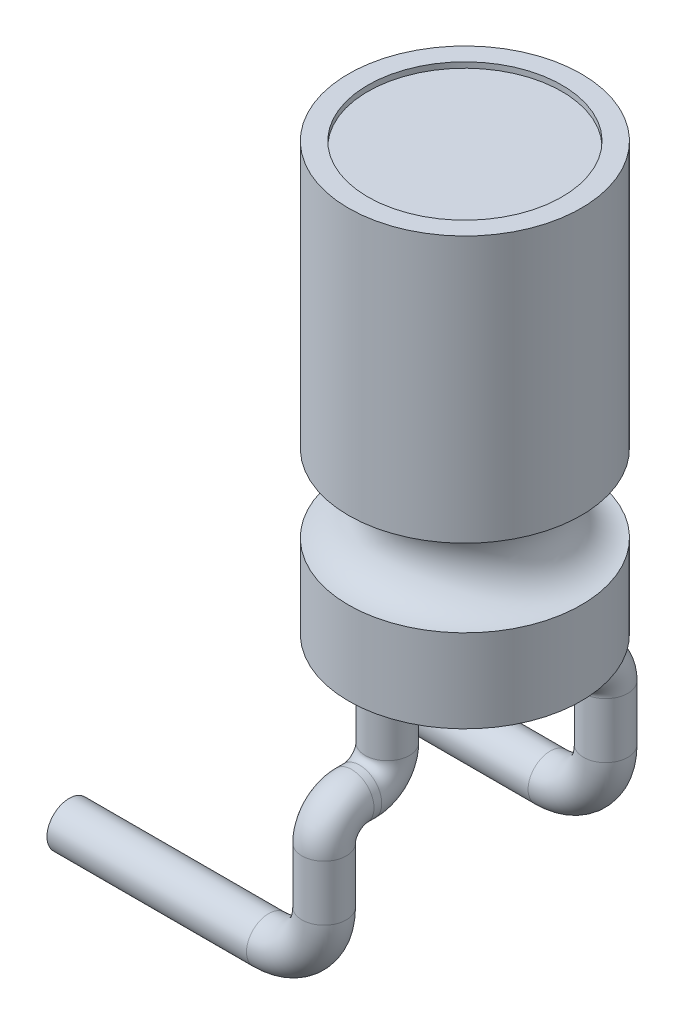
from build123d import *

# Parameters (mm, degrees)
ESQUISSE2_R             = 1.75
ENL_V_MAT_EXTRU_1_DEPTH = 0.1
ESQUISSE3_R             = 0.4
ESQUISSE5_R             = 0.4


with BuildPart() as part:
    # Esquisse1 → R_volution1 (revolve)
    with BuildSketch(Plane.XY, mode=Mode.PRIVATE) as r_volution1_sk:
        with BuildLine():
            Line((0, 35.216423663), (2.1, 35.216423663))
            Line((2.1, 35.216423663), (2.1, 30.416423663))
            ThreePointArc((2.1, 30.416423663), (1.4, 29.716423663), (2.1, 29.016423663))
            Line((2.1, 29.016423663), (2.1, 27.516423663))
            Line((2.1, 27.516423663), (0, 27.516423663))
            Line((0, 27.516423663), (0, 35.216423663))
        make_face()
    revolve(r_volution1_sk.sketch.rotate(Axis((0, 48.401709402, 0), (0, -1, 0)), 90), axis=Axis((0, 48.401709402, 0), (0, -1, 0)))

    # Esquisse2 → Enl_v. mat.-Extru.1 (cut)
    with BuildSketch(Plane(origin=(0, 35.216423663, 0), x_dir=(-1, 0, 0), z_dir=(0, 1, 0))):
        with Locations(Location((0, 0, 0), (0, 0, 90))):
            Circle(ESQUISSE2_R)
    extrude(amount=-ENL_V_MAT_EXTRU_1_DEPTH, mode=Mode.SUBTRACT)

    # Balayage1: sweep along a path in Esquisse4
    with BuildLine(Plane(origin=(0, 0, 0), x_dir=(0, 0, -1), z_dir=(1, 0, 0))) as balayage1_path:
        Line((-1.4, 27.516423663), (-1.4, 26.516423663))
        ThreePointArc((-1.4, 26.516423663), (-1.546446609, 26.162870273), (-1.9, 26.016423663))
        Line((-1.9, 26.016423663), (-2.04, 26.016423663))
        ThreePointArc((-2.04, 26.016423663), (-2.393553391, 25.869977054), (-2.54, 25.516423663))
    # Esquisse3 → Balayage1 (sweep)
    with BuildSketch(Plane.XZ.offset(-27.516423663)):
        with Locations((0, 1.4)):
            Circle(ESQUISSE3_R)
    balayage1 = sweep(path=balayage1_path.line)

    # Balayage2: sweep along a path in Esquisse6
    with BuildLine(Plane.XY.offset(2.54)) as balayage2_path:
        Line((0, 25.516423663), (0, 24.516423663))
        ThreePointArc((0, 24.516423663), (-0.292893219, 23.809316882), (-1, 23.516423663))
        Line((-1, 23.516423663), (-4.6, 23.516423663))
    # Esquisse5 → Balayage2 (sweep)
    with BuildSketch(Plane.XZ.offset(-25.516423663)):
        with Locations((0, 2.54)):
            Circle(ESQUISSE5_R)
    balayage2 = sweep(path=balayage2_path.line)

    # Sym_trie1: Balayage1, Balayage2 across plane
    add(balayage1.mirror(Plane.XY))
    add(balayage2.mirror(Plane.XY))


solid = part.part
